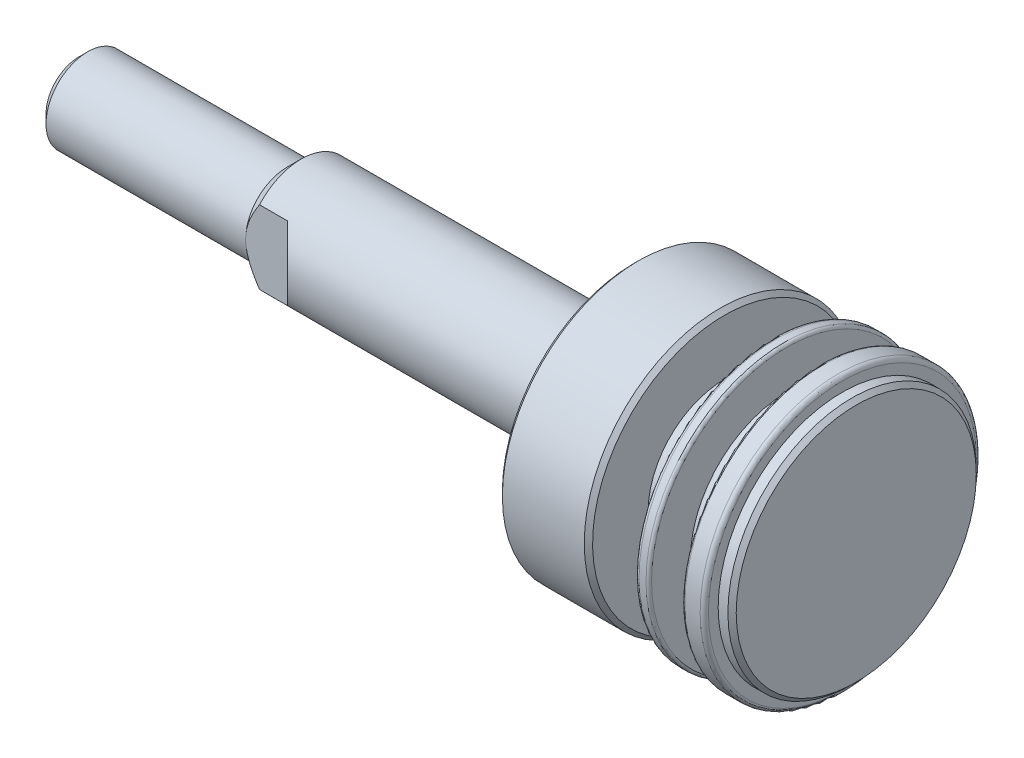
ISO-10303-21;
HEADER;
FILE_DESCRIPTION(('STEP AP214'),'2;1');
FILE_NAME('part.step','',(''),(''),'','','');
FILE_SCHEMA(('AUTOMOTIVE_DESIGN { 1 0 10303 214 1 1 1 1 }'));
ENDSEC;
DATA;
#1=APPLICATION_CONTEXT('core data for automotive mechanical design processes');
#2=APPLICATION_PROTOCOL_DEFINITION('international standard','automotive_design',2000,#1);
#3=PRODUCT_CONTEXT('',#1,'mechanical');
#4=PRODUCT('Part','Part','',(#3));
#5=PRODUCT_RELATED_PRODUCT_CATEGORY('part','',(#4));
#6=PRODUCT_DEFINITION_FORMATION('','',#4);
#7=PRODUCT_DEFINITION_CONTEXT('part definition',#1,'design');
#8=PRODUCT_DEFINITION('design','',#6,#7);
#9=PRODUCT_DEFINITION_SHAPE('','',#8);
#10=(LENGTH_UNIT() NAMED_UNIT(*) SI_UNIT(.MILLI.,.METRE.));
#11=(NAMED_UNIT(*) PLANE_ANGLE_UNIT() SI_UNIT($,.RADIAN.));
#12=(NAMED_UNIT(*) SI_UNIT($,.STERADIAN.) SOLID_ANGLE_UNIT());
#13=UNCERTAINTY_MEASURE_WITH_UNIT(LENGTH_MEASURE(1.E-05),#10,'distance_accuracy_value','');
#14=(GEOMETRIC_REPRESENTATION_CONTEXT(3) GLOBAL_UNCERTAINTY_ASSIGNED_CONTEXT((#13)) GLOBAL_UNIT_ASSIGNED_CONTEXT((#10,
#11,#12)) REPRESENTATION_CONTEXT('',''));
#15=CARTESIAN_POINT('',(0.,0.,0.));
#16=DIRECTION('',(0.,0.,1.));
#17=DIRECTION('',(1.,0.,0.));
#18=AXIS2_PLACEMENT_3D('',#15,#16,#17);
#19=CARTESIAN_POINT('',(35.5,8.65,0.));
#20=DIRECTION('',(-1.,0.,0.));
#21=DIRECTION('',(0.,0.,1.));
#22=AXIS2_PLACEMENT_3D('',#19,#20,#21);
#23=PLANE('',#22);
#24=CARTESIAN_POINT('',(35.5,0.,0.));
#25=DIRECTION('',(-1.,0.,0.));
#26=DIRECTION('',(0.,0.,1.));
#27=AXIS2_PLACEMENT_3D('',#24,#25,#26);
#28=CIRCLE('',#27,8.65);
#29=CARTESIAN_POINT('',(35.5,0.,8.65));
#30=VERTEX_POINT('',#29);
#31=EDGE_CURVE('E265',#30,#30,#28,.T.);
#32=ORIENTED_EDGE('',*,*,#31,.F.);
#33=EDGE_LOOP('',(#32));
#34=FACE_BOUND('',#33,.T.);
#35=ADVANCED_FACE('F17',(#34),#23,.F.);
#36=CARTESIAN_POINT('',(35.2,0.,0.));
#37=DIRECTION('',(-1.,0.,0.));
#38=DIRECTION('',(0.,0.,1.));
#39=AXIS2_PLACEMENT_3D('',#36,#37,#38);
#40=CONICAL_SURFACE('',#39,8.95000000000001,0.785398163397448);
#41=CARTESIAN_POINT('',(35.2,0.,0.));
#42=DIRECTION('',(-1.,0.,0.));
#43=DIRECTION('',(0.,0.,1.));
#44=AXIS2_PLACEMENT_3D('',#41,#42,#43);
#45=CIRCLE('',#44,8.95);
#46=CARTESIAN_POINT('',(35.2,0.,8.95));
#47=VERTEX_POINT('',#46);
#48=EDGE_CURVE('E117',#47,#47,#45,.T.);
#49=ORIENTED_EDGE('',*,*,#48,.F.);
#50=EDGE_LOOP('',(#49));
#51=FACE_BOUND('',#50,.T.);
#52=ORIENTED_EDGE('',*,*,#31,.T.);
#53=EDGE_LOOP('',(#52));
#54=FACE_BOUND('',#53,.T.);
#55=ADVANCED_FACE('F274',(#51,#54),#40,.T.);
#56=CARTESIAN_POINT('',(35.5,0.,0.));
#57=DIRECTION('',(-1.,0.,0.));
#58=DIRECTION('',(0.,0.,1.));
#59=AXIS2_PLACEMENT_3D('',#56,#57,#58);
#60=CYLINDRICAL_SURFACE('',#59,8.95);
#61=CARTESIAN_POINT('',(34.5,0.,0.));
#62=DIRECTION('',(-1.,0.,0.));
#63=DIRECTION('',(0.,0.,1.));
#64=AXIS2_PLACEMENT_3D('',#61,#62,#63);
#65=CIRCLE('',#64,8.95);
#66=CARTESIAN_POINT('',(34.5,0.,8.95));
#67=VERTEX_POINT('',#66);
#68=EDGE_CURVE('E103',#67,#67,#65,.F.);
#69=ORIENTED_EDGE('',*,*,#68,.T.);
#70=EDGE_LOOP('',(#69));
#71=FACE_BOUND('',#70,.T.);
#72=ORIENTED_EDGE('',*,*,#48,.T.);
#73=EDGE_LOOP('',(#72));
#74=FACE_BOUND('',#73,.T.);
#75=ADVANCED_FACE('F272',(#71,#74),#60,.T.);
#76=CARTESIAN_POINT('',(34.5,9.65,0.));
#77=DIRECTION('',(-1.,0.,0.));
#78=DIRECTION('',(0.,0.,1.));
#79=AXIS2_PLACEMENT_3D('',#76,#77,#78);
#80=PLANE('',#79);
#81=ORIENTED_EDGE('',*,*,#68,.F.);
#82=EDGE_LOOP('',(#81));
#83=FACE_BOUND('',#82,.T.);
#84=CARTESIAN_POINT('',(34.5,0.,0.));
#85=DIRECTION('',(-1.,0.,0.));
#86=DIRECTION('',(0.,0.,-1.));
#87=AXIS2_PLACEMENT_3D('',#84,#85,#86);
#88=CIRCLE('',#87,9.65);
#89=CARTESIAN_POINT('',(34.5,0.,-9.65));
#90=VERTEX_POINT('',#89);
#91=CARTESIAN_POINT('',(34.5,0.,9.65));
#92=VERTEX_POINT('',#91);
#93=EDGE_CURVE('E99',#90,#92,#88,.T.);
#94=ORIENTED_EDGE('',*,*,#93,.F.);
#95=CARTESIAN_POINT('',(34.5,0.,0.));
#96=DIRECTION('',(-1.,0.,0.));
#97=DIRECTION('',(0.,0.,1.));
#98=AXIS2_PLACEMENT_3D('',#95,#96,#97);
#99=CIRCLE('',#98,9.65);
#100=EDGE_CURVE('E96',#92,#90,#99,.T.);
#101=ORIENTED_EDGE('',*,*,#100,.F.);
#102=EDGE_LOOP('',(#94,#101));
#103=FACE_BOUND('',#102,.T.);
#104=ADVANCED_FACE('F101',(#83,#103),#80,.F.);
#105=CARTESIAN_POINT('',(34.2,0.,0.));
#106=DIRECTION('',(-1.,0.,0.));
#107=DIRECTION('',(0.,0.,1.));
#108=AXIS2_PLACEMENT_3D('',#105,#106,#107);
#109=TOROIDAL_SURFACE('',#108,9.65,0.300000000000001);
#110=CARTESIAN_POINT('',(34.2,0.,0.));
#111=DIRECTION('',(-1.,0.,0.));
#112=DIRECTION('',(0.,0.,1.));
#113=AXIS2_PLACEMENT_3D('',#110,#111,#112);
#114=CIRCLE('',#113,9.95);
#115=CARTESIAN_POINT('',(34.2,0.,9.95));
#116=VERTEX_POINT('',#115);
#117=EDGE_CURVE('E108',#116,#116,#114,.T.);
#118=ORIENTED_EDGE('',*,*,#117,.F.);
#119=EDGE_LOOP('',(#118));
#120=FACE_BOUND('',#119,.T.);
#121=ORIENTED_EDGE('',*,*,#100,.T.);
#122=ORIENTED_EDGE('',*,*,#93,.T.);
#123=EDGE_LOOP('',(#121,#122));
#124=FACE_BOUND('',#123,.T.);
#125=ADVANCED_FACE('F107',(#120,#124),#109,.T.);
#126=CARTESIAN_POINT('',(35.5,0.,0.));
#127=DIRECTION('',(-1.,0.,0.));
#128=DIRECTION('',(0.,0.,1.));
#129=AXIS2_PLACEMENT_3D('',#126,#127,#128);
#130=CYLINDRICAL_SURFACE('',#129,9.95);
#131=CARTESIAN_POINT('',(33.1,0.,0.));
#132=DIRECTION('',(-1.,0.,0.));
#133=DIRECTION('',(0.,0.,1.));
#134=AXIS2_PLACEMENT_3D('',#131,#132,#133);
#135=CIRCLE('',#134,9.95);
#136=CARTESIAN_POINT('',(33.1,0.,9.95));
#137=VERTEX_POINT('',#136);
#138=EDGE_CURVE('E136',#137,#137,#135,.T.);
#139=ORIENTED_EDGE('',*,*,#138,.F.);
#140=EDGE_LOOP('',(#139));
#141=FACE_BOUND('',#140,.T.);
#142=ORIENTED_EDGE('',*,*,#117,.T.);
#143=EDGE_LOOP('',(#142));
#144=FACE_BOUND('',#143,.T.);
#145=ADVANCED_FACE('F126',(#141,#144),#130,.T.);
#146=CARTESIAN_POINT('',(33.1,0.,0.));
#147=DIRECTION('',(-1.,0.,0.));
#148=DIRECTION('',(0.,0.,1.));
#149=AXIS2_PLACEMENT_3D('',#146,#147,#148);
#150=TOROIDAL_SURFACE('',#149,9.75,0.2);
#151=CARTESIAN_POINT('',(32.9,0.,0.));
#152=DIRECTION('',(1.,0.,0.));
#153=DIRECTION('',(0.,0.,1.));
#154=AXIS2_PLACEMENT_3D('',#151,#152,#153);
#155=CIRCLE('',#154,9.75);
#156=CARTESIAN_POINT('',(32.9,0.,9.75));
#157=VERTEX_POINT('',#156);
#158=CARTESIAN_POINT('',(32.9,0.,-9.75));
#159=VERTEX_POINT('',#158);
#160=EDGE_CURVE('E139',#157,#159,#155,.T.);
#161=ORIENTED_EDGE('',*,*,#160,.T.);
#162=CARTESIAN_POINT('',(32.9,0.,0.));
#163=DIRECTION('',(1.,0.,0.));
#164=DIRECTION('',(0.,0.,-1.));
#165=AXIS2_PLACEMENT_3D('',#162,#163,#164);
#166=CIRCLE('',#165,9.75);
#167=EDGE_CURVE('E172',#159,#157,#166,.T.);
#168=ORIENTED_EDGE('',*,*,#167,.T.);
#169=EDGE_LOOP('',(#161,#168));
#170=FACE_BOUND('',#169,.T.);
#171=ORIENTED_EDGE('',*,*,#138,.T.);
#172=EDGE_LOOP('',(#171));
#173=FACE_BOUND('',#172,.T.);
#174=ADVANCED_FACE('F144',(#170,#173),#150,.T.);
#175=CARTESIAN_POINT('',(32.9,6.95,0.));
#176=DIRECTION('',(1.,0.,0.));
#177=DIRECTION('',(0.,0.,-1.));
#178=AXIS2_PLACEMENT_3D('',#175,#176,#177);
#179=PLANE('',#178);
#180=ORIENTED_EDGE('',*,*,#160,.F.);
#181=ORIENTED_EDGE('',*,*,#167,.F.);
#182=EDGE_LOOP('',(#180,#181));
#183=FACE_BOUND('',#182,.T.);
#184=CARTESIAN_POINT('',(32.9,0.,0.));
#185=DIRECTION('',(-1.,0.,0.));
#186=DIRECTION('',(0.,0.,1.));
#187=AXIS2_PLACEMENT_3D('',#184,#185,#186);
#188=CIRCLE('',#187,6.95);
#189=CARTESIAN_POINT('',(32.9,0.,6.95));
#190=VERTEX_POINT('',#189);
#191=EDGE_CURVE('E254',#190,#190,#188,.T.);
#192=ORIENTED_EDGE('',*,*,#191,.F.);
#193=EDGE_LOOP('',(#192));
#194=FACE_BOUND('',#193,.T.);
#195=ADVANCED_FACE('F153',(#183,#194),#179,.F.);
#196=CARTESIAN_POINT('',(35.5,0.,0.));
#197=DIRECTION('',(-1.,0.,0.));
#198=DIRECTION('',(0.,0.,1.));
#199=AXIS2_PLACEMENT_3D('',#196,#197,#198);
#200=CYLINDRICAL_SURFACE('',#199,6.95);
#201=CARTESIAN_POINT('',(30.5,0.,0.));
#202=DIRECTION('',(-1.,0.,0.));
#203=DIRECTION('',(0.,0.,1.));
#204=AXIS2_PLACEMENT_3D('',#201,#202,#203);
#205=CIRCLE('',#204,6.95);
#206=CARTESIAN_POINT('',(30.5,0.,6.95));
#207=VERTEX_POINT('',#206);
#208=EDGE_CURVE('E232',#207,#207,#205,.F.);
#209=ORIENTED_EDGE('',*,*,#208,.T.);
#210=EDGE_LOOP('',(#209));
#211=FACE_BOUND('',#210,.T.);
#212=ORIENTED_EDGE('',*,*,#191,.T.);
#213=EDGE_LOOP('',(#212));
#214=FACE_BOUND('',#213,.T.);
#215=ADVANCED_FACE('F609',(#211,#214),#200,.T.);
#216=CARTESIAN_POINT('',(30.5,9.75,0.));
#217=DIRECTION('',(-1.,0.,0.));
#218=DIRECTION('',(0.,0.,1.));
#219=AXIS2_PLACEMENT_3D('',#216,#217,#218);
#220=PLANE('',#219);
#221=ORIENTED_EDGE('',*,*,#208,.F.);
#222=EDGE_LOOP('',(#221));
#223=FACE_BOUND('',#222,.T.);
#224=CARTESIAN_POINT('',(30.5,0.,0.));
#225=DIRECTION('',(-1.,0.,0.));
#226=DIRECTION('',(0.,0.,-1.));
#227=AXIS2_PLACEMENT_3D('',#224,#225,#226);
#228=CIRCLE('',#227,9.75);
#229=CARTESIAN_POINT('',(30.5,0.,-9.75));
#230=VERTEX_POINT('',#229);
#231=CARTESIAN_POINT('',(30.5,0.,9.75));
#232=VERTEX_POINT('',#231);
#233=EDGE_CURVE('E213',#230,#232,#228,.T.);
#234=ORIENTED_EDGE('',*,*,#233,.F.);
#235=CARTESIAN_POINT('',(30.5,0.,0.));
#236=DIRECTION('',(-1.,0.,0.));
#237=DIRECTION('',(0.,0.,1.));
#238=AXIS2_PLACEMENT_3D('',#235,#236,#237);
#239=CIRCLE('',#238,9.75);
#240=EDGE_CURVE('E222',#232,#230,#239,.T.);
#241=ORIENTED_EDGE('',*,*,#240,.F.);
#242=EDGE_LOOP('',(#234,#241));
#243=FACE_BOUND('',#242,.T.);
#244=ADVANCED_FACE('F200',(#223,#243),#220,.F.);
#245=CARTESIAN_POINT('',(30.3,0.,0.));
#246=DIRECTION('',(-1.,0.,0.));
#247=DIRECTION('',(0.,0.,1.));
#248=AXIS2_PLACEMENT_3D('',#245,#246,#247);
#249=TOROIDAL_SURFACE('',#248,9.75,0.199999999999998);
#250=CARTESIAN_POINT('',(30.3,0.,0.));
#251=DIRECTION('',(-1.,0.,0.));
#252=DIRECTION('',(0.,0.,1.));
#253=AXIS2_PLACEMENT_3D('',#250,#251,#252);
#254=CIRCLE('',#253,9.95);
#255=CARTESIAN_POINT('',(30.3,0.,9.95));
#256=VERTEX_POINT('',#255);
#257=EDGE_CURVE('E208',#256,#256,#254,.T.);
#258=ORIENTED_EDGE('',*,*,#257,.F.);
#259=EDGE_LOOP('',(#258));
#260=FACE_BOUND('',#259,.T.);
#261=ORIENTED_EDGE('',*,*,#240,.T.);
#262=ORIENTED_EDGE('',*,*,#233,.T.);
#263=EDGE_LOOP('',(#261,#262));
#264=FACE_BOUND('',#263,.T.);
#265=ADVANCED_FACE('F188',(#260,#264),#249,.T.);
#266=CARTESIAN_POINT('',(35.5,0.,0.));
#267=DIRECTION('',(-1.,0.,0.));
#268=DIRECTION('',(0.,0.,1.));
#269=AXIS2_PLACEMENT_3D('',#266,#267,#268);
#270=CYLINDRICAL_SURFACE('',#269,9.95);
#271=CARTESIAN_POINT('',(29.8,0.,0.));
#272=DIRECTION('',(-1.,0.,0.));
#273=DIRECTION('',(0.,0.,1.));
#274=AXIS2_PLACEMENT_3D('',#271,#272,#273);
#275=CIRCLE('',#274,9.95);
#276=CARTESIAN_POINT('',(29.8,0.,9.95));
#277=VERTEX_POINT('',#276);
#278=EDGE_CURVE('E429',#277,#277,#275,.T.);
#279=ORIENTED_EDGE('',*,*,#278,.F.);
#280=EDGE_LOOP('',(#279));
#281=FACE_BOUND('',#280,.T.);
#282=ORIENTED_EDGE('',*,*,#257,.T.);
#283=EDGE_LOOP('',(#282));
#284=FACE_BOUND('',#283,.T.);
#285=ADVANCED_FACE('F199',(#281,#284),#270,.T.);
#286=CARTESIAN_POINT('',(29.8,0.,0.));
#287=DIRECTION('',(-1.,0.,0.));
#288=DIRECTION('',(0.,0.,1.));
#289=AXIS2_PLACEMENT_3D('',#286,#287,#288);
#290=TOROIDAL_SURFACE('',#289,9.65,0.299999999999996);
#291=CARTESIAN_POINT('',(29.5,0.,0.));
#292=DIRECTION('',(1.,0.,0.));
#293=DIRECTION('',(0.,0.,1.));
#294=AXIS2_PLACEMENT_3D('',#291,#292,#293);
#295=CIRCLE('',#294,9.65);
#296=CARTESIAN_POINT('',(29.5,0.,9.65));
#297=VERTEX_POINT('',#296);
#298=CARTESIAN_POINT('',(29.5,0.,-9.65));
#299=VERTEX_POINT('',#298);
#300=EDGE_CURVE('E75',#297,#299,#295,.T.);
#301=ORIENTED_EDGE('',*,*,#300,.T.);
#302=CARTESIAN_POINT('',(29.5,0.,0.));
#303=DIRECTION('',(1.,0.,0.));
#304=DIRECTION('',(0.,0.,-1.));
#305=AXIS2_PLACEMENT_3D('',#302,#303,#304);
#306=CIRCLE('',#305,9.65);
#307=EDGE_CURVE('E426',#299,#297,#306,.T.);
#308=ORIENTED_EDGE('',*,*,#307,.T.);
#309=EDGE_LOOP('',(#301,#308));
#310=FACE_BOUND('',#309,.T.);
#311=ORIENTED_EDGE('',*,*,#278,.T.);
#312=EDGE_LOOP('',(#311));
#313=FACE_BOUND('',#312,.T.);
#314=ADVANCED_FACE('F411',(#310,#313),#290,.T.);
#315=CARTESIAN_POINT('',(29.5,5.5,0.));
#316=DIRECTION('',(1.,0.,0.));
#317=DIRECTION('',(0.,0.,-1.));
#318=AXIS2_PLACEMENT_3D('',#315,#316,#317);
#319=PLANE('',#318);
#320=ORIENTED_EDGE('',*,*,#300,.F.);
#321=ORIENTED_EDGE('',*,*,#307,.F.);
#322=EDGE_LOOP('',(#320,#321));
#323=FACE_BOUND('',#322,.T.);
#324=CARTESIAN_POINT('',(29.5,0.,0.));
#325=DIRECTION('',(-1.,0.,0.));
#326=DIRECTION('',(0.,0.,1.));
#327=AXIS2_PLACEMENT_3D('',#324,#325,#326);
#328=CIRCLE('',#327,5.5);
#329=CARTESIAN_POINT('',(29.5,0.,5.5));
#330=VERTEX_POINT('',#329);
#331=EDGE_CURVE('E713',#330,#330,#328,.T.);
#332=ORIENTED_EDGE('',*,*,#331,.F.);
#333=EDGE_LOOP('',(#332));
#334=FACE_BOUND('',#333,.T.);
#335=ADVANCED_FACE('F401',(#323,#334),#319,.F.);
#336=CARTESIAN_POINT('',(35.5,0.,0.));
#337=DIRECTION('',(-1.,0.,0.));
#338=DIRECTION('',(0.,0.,1.));
#339=AXIS2_PLACEMENT_3D('',#336,#337,#338);
#340=CYLINDRICAL_SURFACE('',#339,5.5);
#341=CARTESIAN_POINT('',(26.,0.,0.));
#342=DIRECTION('',(-1.,0.,0.));
#343=DIRECTION('',(0.,0.,1.));
#344=AXIS2_PLACEMENT_3D('',#341,#342,#343);
#345=CIRCLE('',#344,5.5);
#346=CARTESIAN_POINT('',(26.,0.,5.5));
#347=VERTEX_POINT('',#346);
#348=EDGE_CURVE('E711',#347,#347,#345,.F.);
#349=ORIENTED_EDGE('',*,*,#348,.T.);
#350=EDGE_LOOP('',(#349));
#351=FACE_BOUND('',#350,.T.);
#352=ORIENTED_EDGE('',*,*,#331,.T.);
#353=EDGE_LOOP('',(#352));
#354=FACE_BOUND('',#353,.T.);
#355=ADVANCED_FACE('F410',(#351,#354),#340,.T.);
#356=CARTESIAN_POINT('',(26.,9.5,0.));
#357=DIRECTION('',(-1.,0.,0.));
#358=DIRECTION('',(0.,0.,1.));
#359=AXIS2_PLACEMENT_3D('',#356,#357,#358);
#360=PLANE('',#359);
#361=ORIENTED_EDGE('',*,*,#348,.F.);
#362=EDGE_LOOP('',(#361));
#363=FACE_BOUND('',#362,.T.);
#364=CARTESIAN_POINT('',(26.,0.,0.));
#365=DIRECTION('',(-1.,0.,0.));
#366=DIRECTION('',(0.,-1.,0.));
#367=AXIS2_PLACEMENT_3D('',#364,#365,#366);
#368=CIRCLE('',#367,9.5);
#369=CARTESIAN_POINT('',(26.,-9.5,0.));
#370=VERTEX_POINT('',#369);
#371=EDGE_CURVE('E393',#370,#370,#368,.T.);
#372=ORIENTED_EDGE('',*,*,#371,.F.);
#373=EDGE_LOOP('',(#372));
#374=FACE_BOUND('',#373,.T.);
#375=ADVANCED_FACE('F460',(#363,#374),#360,.F.);
#376=CARTESIAN_POINT('',(25.7,0.,0.));
#377=DIRECTION('',(-1.,0.,0.));
#378=DIRECTION('',(0.,-1.,0.));
#379=AXIS2_PLACEMENT_3D('',#376,#377,#378);
#380=CONICAL_SURFACE('',#379,9.8,0.785398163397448);
#381=ORIENTED_EDGE('',*,*,#371,.T.);
#382=EDGE_LOOP('',(#381));
#383=FACE_BOUND('',#382,.T.);
#384=CARTESIAN_POINT('',(25.7,0.,0.));
#385=DIRECTION('',(-1.,0.,0.));
#386=DIRECTION('',(0.,0.,1.));
#387=AXIS2_PLACEMENT_3D('',#384,#385,#386);
#388=CIRCLE('',#387,9.8);
#389=CARTESIAN_POINT('',(25.7,0.,9.8));
#390=VERTEX_POINT('',#389);
#391=EDGE_CURVE('E390',#390,#390,#388,.T.);
#392=ORIENTED_EDGE('',*,*,#391,.F.);
#393=EDGE_LOOP('',(#392));
#394=FACE_BOUND('',#393,.T.);
#395=ADVANCED_FACE('F467',(#383,#394),#380,.T.);
#396=CARTESIAN_POINT('',(-20.5,0.,0.));
#397=DIRECTION('',(1.,0.,0.));
#398=DIRECTION('',(0.,0.,-1.));
#399=AXIS2_PLACEMENT_3D('',#396,#397,#398);
#400=PLANE('',#399);
#401=CARTESIAN_POINT('',(-20.49999999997,0.,0.));
#402=DIRECTION('',(1.,0.,0.));
#403=DIRECTION('',(0.,0.,-1.));
#404=AXIS2_PLACEMENT_3D('',#401,#402,#403);
#405=CIRCLE('',#404,2.38649999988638);
#406=CARTESIAN_POINT('',(-20.49999999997,0.,-2.38649999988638));
#407=VERTEX_POINT('',#406);
#408=EDGE_CURVE('E389',#407,#407,#405,.T.);
#409=ORIENTED_EDGE('',*,*,#408,.F.);
#410=EDGE_LOOP('',(#409));
#411=FACE_BOUND('',#410,.T.);
#412=ADVANCED_FACE('F474',(#411),#400,.F.);
#413=CARTESIAN_POINT('',(35.5,0.,0.));
#414=DIRECTION('',(-1.,0.,0.));
#415=DIRECTION('',(0.,0.,1.));
#416=AXIS2_PLACEMENT_3D('',#413,#414,#415);
#417=CYLINDRICAL_SURFACE('',#416,9.8);
#418=ORIENTED_EDGE('',*,*,#391,.T.);
#419=EDGE_LOOP('',(#418));
#420=FACE_BOUND('',#419,.T.);
#421=CARTESIAN_POINT('',(19.8,0.,0.));
#422=DIRECTION('',(1.,0.,0.));
#423=DIRECTION('',(0.,0.,-1.));
#424=AXIS2_PLACEMENT_3D('',#421,#422,#423);
#425=CIRCLE('',#424,9.8);
#426=CARTESIAN_POINT('',(19.8,0.,-9.8));
#427=VERTEX_POINT('',#426);
#428=EDGE_CURVE('E386',#427,#427,#425,.F.);
#429=ORIENTED_EDGE('',*,*,#428,.F.);
#430=EDGE_LOOP('',(#429));
#431=FACE_BOUND('',#430,.T.);
#432=ADVANCED_FACE('F482',(#420,#431),#417,.T.);
#433=CARTESIAN_POINT('',(-19.8864999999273,0.,0.));
#434=DIRECTION('',(1.,0.,0.));
#435=DIRECTION('',(0.,0.,-1.));
#436=AXIS2_PLACEMENT_3D('',#433,#434,#435);
#437=CONICAL_SURFACE('',#436,2.99999999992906,0.785398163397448);
#438=CARTESIAN_POINT('',(-19.8865,0.,0.));
#439=DIRECTION('',(-1.,0.,0.));
#440=DIRECTION('',(0.,0.,1.));
#441=AXIS2_PLACEMENT_3D('',#438,#439,#440);
#442=CIRCLE('',#441,3.);
#443=CARTESIAN_POINT('',(-19.8865,0.,3.));
#444=VERTEX_POINT('',#443);
#445=EDGE_CURVE('E383',#444,#444,#442,.F.);
#446=ORIENTED_EDGE('',*,*,#445,.F.);
#447=EDGE_LOOP('',(#446));
#448=FACE_BOUND('',#447,.T.);
#449=ORIENTED_EDGE('',*,*,#408,.T.);
#450=EDGE_LOOP('',(#449));
#451=FACE_BOUND('',#450,.T.);
#452=ADVANCED_FACE('F490',(#448,#451),#437,.T.);
#453=CARTESIAN_POINT('',(19.8,0.,0.));
#454=DIRECTION('',(1.,0.,0.));
#455=DIRECTION('',(0.,1.,0.));
#456=AXIS2_PLACEMENT_3D('',#453,#454,#455);
#457=CONICAL_SURFACE('',#456,9.8,0.785398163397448);
#458=CARTESIAN_POINT('',(19.5,0.,0.));
#459=DIRECTION('',(1.,0.,0.));
#460=DIRECTION('',(0.,1.,0.));
#461=AXIS2_PLACEMENT_3D('',#458,#459,#460);
#462=CIRCLE('',#461,9.5);
#463=CARTESIAN_POINT('',(19.5,9.5,0.));
#464=VERTEX_POINT('',#463);
#465=EDGE_CURVE('E339',#464,#464,#462,.T.);
#466=ORIENTED_EDGE('',*,*,#465,.T.);
#467=EDGE_LOOP('',(#466));
#468=FACE_BOUND('',#467,.T.);
#469=ORIENTED_EDGE('',*,*,#428,.T.);
#470=EDGE_LOOP('',(#469));
#471=FACE_BOUND('',#470,.T.);
#472=ADVANCED_FACE('F498',(#468,#471),#457,.T.);
#473=CARTESIAN_POINT('',(0.,0.,0.));
#474=DIRECTION('',(-1.,0.,0.));
#475=DIRECTION('',(0.,0.,1.));
#476=AXIS2_PLACEMENT_3D('',#473,#474,#475);
#477=CYLINDRICAL_SURFACE('',#476,3.);
#478=ORIENTED_EDGE('',*,*,#445,.T.);
#479=EDGE_LOOP('',(#478));
#480=FACE_BOUND('',#479,.T.);
#481=CARTESIAN_POINT('',(-5.49999999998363,0.,0.));
#482=DIRECTION('',(1.,0.,0.));
#483=DIRECTION('',(0.,0.,-1.));
#484=AXIS2_PLACEMENT_3D('',#481,#482,#483);
#485=CIRCLE('',#484,2.9999999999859);
#486=CARTESIAN_POINT('',(-5.49999999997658,0.,-2.99999999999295));
#487=VERTEX_POINT('',#486);
#488=CARTESIAN_POINT('',(-5.49999999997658,0.,2.99999999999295));
#489=VERTEX_POINT('',#488);
#490=EDGE_CURVE('E317',#487,#489,#485,.T.);
#491=ORIENTED_EDGE('',*,*,#490,.F.);
#492=CARTESIAN_POINT('',(-5.49999999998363,0.,0.));
#493=DIRECTION('',(1.,0.,0.));
#494=DIRECTION('',(0.,0.,-1.));
#495=AXIS2_PLACEMENT_3D('',#492,#493,#494);
#496=CIRCLE('',#495,2.9999999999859);
#497=EDGE_CURVE('E67',#489,#487,#496,.T.);
#498=ORIENTED_EDGE('',*,*,#497,.F.);
#499=EDGE_LOOP('',(#491,#498));
#500=FACE_BOUND('',#499,.T.);
#501=ADVANCED_FACE('F329',(#480,#500),#477,.T.);
#502=CARTESIAN_POINT('',(-4.49999999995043,0.,0.));
#503=DIRECTION('',(1.,0.,0.));
#504=DIRECTION('',(0.,0.,-1.));
#505=AXIS2_PLACEMENT_3D('',#502,#503,#504);
#506=CONICAL_SURFACE('',#505,4.0000000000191,0.785398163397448);
#507=CARTESIAN_POINT('',(-4.4999999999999,0.,0.));
#508=DIRECTION('',(-1.,0.,0.));
#509=DIRECTION('',(0.,0.,1.));
#510=AXIS2_PLACEMENT_3D('',#507,#508,#509);
#511=CIRCLE('',#510,4.);
#512=CARTESIAN_POINT('',(-4.49999999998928,-2.6457513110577,3.));
#513=VERTEX_POINT('',#512);
#514=CARTESIAN_POINT('',(-4.49999999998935,-2.64575131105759,-3.));
#515=VERTEX_POINT('',#514);
#516=EDGE_CURVE('E367',#513,#515,#511,.F.);
#517=ORIENTED_EDGE('',*,*,#516,.F.);
#518=CARTESIAN_POINT('',(-4.49999999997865,-2.6457513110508,3.));
#519=CARTESIAN_POINT('',(-4.54376677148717,-2.57957305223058,3.));
#520=CARTESIAN_POINT('',(-4.58689929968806,-2.51297659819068,3.));
#521=CARTESIAN_POINT('',(-4.67167711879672,-2.37881643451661,3.));
#522=CARTESIAN_POINT('',(-4.71332195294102,-2.3112524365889,3.));
#523=CARTESIAN_POINT('',(-4.83608152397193,-2.10626474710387,3.));
#524=CARTESIAN_POINT('',(-4.91456071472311,-1.96723203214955,3.));
#525=CARTESIAN_POINT('',(-5.0593775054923,-1.68866176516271,3.));
#526=CARTESIAN_POINT('',(-5.12602744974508,-1.54928833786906,3.));
#527=CARTESIAN_POINT('',(-5.2466022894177,-1.26532297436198,3.));
#528=CARTESIAN_POINT('',(-5.30055451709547,-1.12074303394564,3.));
#529=CARTESIAN_POINT('',(-5.37010131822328,-0.895422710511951,3.));
#530=CARTESIAN_POINT('',(-5.39181483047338,-0.816563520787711,3.));
#531=CARTESIAN_POINT('',(-5.42975833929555,-0.657532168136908,3.));
#532=CARTESIAN_POINT('',(-5.44598924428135,-0.577360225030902,3.));
#533=CARTESIAN_POINT('',(-5.47255276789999,-0.414674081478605,3.));
#534=CARTESIAN_POINT('',(-5.48278379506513,-0.332143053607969,3.));
#535=CARTESIAN_POINT('',(-5.49653824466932,-0.166418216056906,3.));
#536=CARTESIAN_POINT('',(-5.5000527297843,-0.0832236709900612,3.));
#537=CARTESIAN_POINT('',(-5.49999999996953,0.,3.));
#538=B_SPLINE_CURVE_WITH_KNOTS('',3,(#518,#519,#520,#521,#522,#523,#524,#525,#526,#527,#528,
#529,#530,#531,#532,#533,#534,#535,#536,#537),.UNSPECIFIED.,.F.,.F.,(4,2,2,2,2,2,2,2,2,4),(0.,
0.238016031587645,0.476104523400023,0.954759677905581,1.41781524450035,1.87986476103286,
2.12508439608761,2.37026338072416,2.6194821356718,2.8690322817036),.UNSPECIFIED.);
#539=EDGE_CURVE('E311',#513,#489,#538,.T.);
#540=ORIENTED_EDGE('',*,*,#539,.T.);
#541=ORIENTED_EDGE('',*,*,#497,.T.);
#542=CARTESIAN_POINT('',(-5.4999999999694,0.,-2.99999999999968));
#543=CARTESIAN_POINT('',(-5.50000372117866,-0.0461316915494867,-2.99999999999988));
#544=CARTESIAN_POINT('',(-5.49893540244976,-0.0922565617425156,-2.99999999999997));
#545=CARTESIAN_POINT('',(-5.49468966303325,-0.18440180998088,-3.00000000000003));
#546=CARTESIAN_POINT('',(-5.49151258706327,-0.23042220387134,-3.00000000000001));
#547=CARTESIAN_POINT('',(-5.47888814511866,-0.368016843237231,-2.99999999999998));
#548=CARTESIAN_POINT('',(-5.46634726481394,-0.459322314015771,-2.99999999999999));
#549=CARTESIAN_POINT('',(-5.43396065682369,-0.638969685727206,-3.00000000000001));
#550=CARTESIAN_POINT('',(-5.41424449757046,-0.727335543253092,-3.));
#551=CARTESIAN_POINT('',(-5.3683603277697,-0.902389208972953,-3.));
#552=CARTESIAN_POINT('',(-5.34218991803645,-0.989076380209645,-3.));
#553=CARTESIAN_POINT('',(-5.2667386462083,-1.21279133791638,-3.));
#554=CARTESIAN_POINT('',(-5.2130870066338,-1.34834245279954,-3.));
#555=CARTESIAN_POINT('',(-5.09509922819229,-1.61482672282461,-3.));
#556=CARTESIAN_POINT('',(-5.03074718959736,-1.74575264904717,-3.));
#557=CARTESIAN_POINT('',(-4.89212992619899,-2.00733665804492,-3.));
#558=CARTESIAN_POINT('',(-4.81762251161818,-2.13786518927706,-3.));
#559=CARTESIAN_POINT('',(-4.7014336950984,-2.33060224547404,-3.));
#560=CARTESIAN_POINT('',(-4.66204708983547,-2.39421775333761,-3.));
#561=CARTESIAN_POINT('',(-4.58196164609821,-2.52059663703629,-3.));
#562=CARTESIAN_POINT('',(-4.54126312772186,-2.58336021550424,-3.));
#563=CARTESIAN_POINT('',(-4.49999999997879,-2.64575131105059,-3.));
#564=B_SPLINE_CURVE_WITH_KNOTS('',3,(#542,#543,#544,#545,#546,#547,#548,#549,#550,#551,#552,
#553,#554,#555,#556,#557,#558,#559,#560,#561,#562,#563),.UNSPECIFIED.,.F.,.F.,(4,2,2,2,2,2,2,2,
2,2,4),(0.,0.138369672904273,0.27671673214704,0.552819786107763,0.82416619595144,
1.0956136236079,1.53229133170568,1.96962379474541,2.42027307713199,2.64472553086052,
2.86912362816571),.UNSPECIFIED.);
#565=EDGE_CURVE('E333',#487,#515,#564,.T.);
#566=ORIENTED_EDGE('',*,*,#565,.T.);
#567=EDGE_LOOP('',(#517,#540,#541,#566));
#568=FACE_BOUND('',#567,.T.);
#569=ADVANCED_FACE('F323',(#568),#506,.T.);
#570=CARTESIAN_POINT('',(19.5,4.,0.));
#571=DIRECTION('',(1.,0.,0.));
#572=DIRECTION('',(0.,0.,-1.));
#573=AXIS2_PLACEMENT_3D('',#570,#571,#572);
#574=PLANE('',#573);
#575=ORIENTED_EDGE('',*,*,#465,.F.);
#576=EDGE_LOOP('',(#575));
#577=FACE_BOUND('',#576,.T.);
#578=CARTESIAN_POINT('',(19.5,0.,0.));
#579=DIRECTION('',(-1.,0.,0.));
#580=DIRECTION('',(0.,0.,1.));
#581=AXIS2_PLACEMENT_3D('',#578,#579,#580);
#582=CIRCLE('',#581,4.);
#583=CARTESIAN_POINT('',(19.5,0.,4.));
#584=VERTEX_POINT('',#583);
#585=EDGE_CURVE('E359',#584,#584,#582,.T.);
#586=ORIENTED_EDGE('',*,*,#585,.F.);
#587=EDGE_LOOP('',(#586));
#588=FACE_BOUND('',#587,.T.);
#589=ADVANCED_FACE('F328',(#577,#588),#574,.F.);
#590=CARTESIAN_POINT('',(-2.5,-6.,-3.));
#591=DIRECTION('',(0.707106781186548,0.,0.707106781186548));
#592=DIRECTION('',(0.707106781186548,0.,-0.707106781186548));
#593=AXIS2_PLACEMENT_3D('',#590,#591,#592);
#594=PLANE('',#593);
#595=CARTESIAN_POINT('',(-5.50000000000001,0.,0.));
#596=DIRECTION('',(0.707106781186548,0.,0.707106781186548));
#597=DIRECTION('',(-0.707106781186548,0.,0.707106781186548));
#598=AXIS2_PLACEMENT_3D('',#595,#596,#597);
#599=ELLIPSE('',#598,5.65685424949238,4.);
#600=CARTESIAN_POINT('',(-2.5,-2.64575131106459,-3.));
#601=VERTEX_POINT('',#600);
#602=CARTESIAN_POINT('',(-2.5,2.64575131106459,-3.));
#603=VERTEX_POINT('',#602);
#604=EDGE_CURVE('E354',#601,#603,#599,.T.);
#605=ORIENTED_EDGE('',*,*,#604,.F.);
#606=DIRECTION('',(0.,1.,0.));
#607=VECTOR('',#606,1.);
#608=CARTESIAN_POINT('',(-2.5,-6.,-3.));
#609=LINE('',#608,#607);
#610=EDGE_CURVE('E338',#601,#603,#609,.T.);
#611=ORIENTED_EDGE('',*,*,#610,.T.);
#612=EDGE_LOOP('',(#605,#611));
#613=FACE_BOUND('',#612,.T.);
#614=ADVANCED_FACE('F344',(#613),#594,.F.);
#615=CARTESIAN_POINT('',(-5.5,-6.,-3.));
#616=DIRECTION('',(0.,0.,1.));
#617=DIRECTION('',(1.,0.,0.));
#618=AXIS2_PLACEMENT_3D('',#615,#616,#617);
#619=PLANE('',#618);
#620=DIRECTION('',(-1.,0.,0.));
#621=VECTOR('',#620,1.);
#622=CARTESIAN_POINT('',(35.5,-2.64575131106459,-3.));
#623=LINE('',#622,#621);
#624=EDGE_CURVE('E362',#515,#601,#623,.F.);
#625=ORIENTED_EDGE('',*,*,#624,.F.);
#626=ORIENTED_EDGE('',*,*,#565,.F.);
#627=CARTESIAN_POINT('',(-4.49999999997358,2.64575131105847,-3.));
#628=CARTESIAN_POINT('',(-4.54376677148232,2.57957305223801,-3.));
#629=CARTESIAN_POINT('',(-4.58689929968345,2.51297659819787,-3.));
#630=CARTESIAN_POINT('',(-4.67167711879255,2.37881643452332,-3.));
#631=CARTESIAN_POINT('',(-4.71332195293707,2.31125243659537,-3.));
#632=CARTESIAN_POINT('',(-4.83608152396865,2.10626474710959,-3.));
#633=CARTESIAN_POINT('',(-4.91456071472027,1.96723203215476,-3.));
#634=CARTESIAN_POINT('',(-5.05937750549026,1.68866176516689,-3.));
#635=CARTESIAN_POINT('',(-5.12602744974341,1.54928833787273,-3.));
#636=CARTESIAN_POINT('',(-5.2466022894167,1.2653229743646,-3.));
#637=CARTESIAN_POINT('',(-5.30055451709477,1.12074303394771,-3.));
#638=CARTESIAN_POINT('',(-5.37010131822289,0.895422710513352,-3.));
#639=CARTESIAN_POINT('',(-5.39181483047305,0.816563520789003,-3.));
#640=CARTESIAN_POINT('',(-5.42975833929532,0.657532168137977,-3.));
#641=CARTESIAN_POINT('',(-5.44598924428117,0.577360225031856,-3.));
#642=CARTESIAN_POINT('',(-5.47255276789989,0.414674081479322,-3.));
#643=CARTESIAN_POINT('',(-5.48278379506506,0.332143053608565,-3.));
#644=CARTESIAN_POINT('',(-5.4965382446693,0.166418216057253,-3.));
#645=CARTESIAN_POINT('',(-5.5000527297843,0.0832236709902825,-3.));
#646=CARTESIAN_POINT('',(-5.49999999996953,0.,-3.));
#647=B_SPLINE_CURVE_WITH_KNOTS('',3,(#627,#628,#629,#630,#631,#632,#633,#634,#635,#636,#637,
#638,#639,#640,#641,#642,#643,#644,#645,#646),.UNSPECIFIED.,.F.,.F.,(4,2,2,2,2,2,2,2,2,4),(0.,
0.238016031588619,0.476104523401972,0.954759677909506,1.41781524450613,1.87986476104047,
2.12508439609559,2.3702633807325,2.61948213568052,2.8690322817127),.UNSPECIFIED.);
#648=CARTESIAN_POINT('',(-4.49999999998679,2.64575131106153,-3.));
#649=VERTEX_POINT('',#648);
#650=EDGE_CURVE('E318',#649,#487,#647,.T.);
#651=ORIENTED_EDGE('',*,*,#650,.F.);
#652=DIRECTION('',(-1.,0.,0.));
#653=VECTOR('',#652,1.);
#654=CARTESIAN_POINT('',(35.5,2.64575131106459,-3.));
#655=LINE('',#654,#653);
#656=EDGE_CURVE('E358',#603,#649,#655,.T.);
#657=ORIENTED_EDGE('',*,*,#656,.F.);
#658=ORIENTED_EDGE('',*,*,#610,.F.);
#659=EDGE_LOOP('',(#625,#626,#651,#657,#658));
#660=FACE_BOUND('',#659,.T.);
#661=ADVANCED_FACE('F341',(#660),#619,.F.);
#662=CARTESIAN_POINT('',(-4.49999999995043,0.,0.));
#663=DIRECTION('',(1.,0.,0.));
#664=DIRECTION('',(0.,0.,-1.));
#665=AXIS2_PLACEMENT_3D('',#662,#663,#664);
#666=CONICAL_SURFACE('',#665,4.0000000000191,0.785398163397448);
#667=ORIENTED_EDGE('',*,*,#490,.T.);
#668=CARTESIAN_POINT('',(-5.49999999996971,0.,3.00000000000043));
#669=CARTESIAN_POINT('',(-5.50000372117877,0.0461316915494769,3.00000000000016));
#670=CARTESIAN_POINT('',(-5.49893540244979,0.0922565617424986,3.00000000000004));
#671=CARTESIAN_POINT('',(-5.49468966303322,0.184401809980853,2.99999999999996));
#672=CARTESIAN_POINT('',(-5.49151258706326,0.230422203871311,2.99999999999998));
#673=CARTESIAN_POINT('',(-5.47888814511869,0.368016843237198,3.00000000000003));
#674=CARTESIAN_POINT('',(-5.46634726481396,0.459322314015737,3.00000000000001));
#675=CARTESIAN_POINT('',(-5.43396065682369,0.638969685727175,2.99999999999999));
#676=CARTESIAN_POINT('',(-5.41424449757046,0.727335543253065,3.));
#677=CARTESIAN_POINT('',(-5.36836032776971,0.902389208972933,3.));
#678=CARTESIAN_POINT('',(-5.34218991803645,0.989076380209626,3.));
#679=CARTESIAN_POINT('',(-5.26673864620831,1.21279133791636,3.));
#680=CARTESIAN_POINT('',(-5.21308700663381,1.34834245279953,3.));
#681=CARTESIAN_POINT('',(-5.09509922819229,1.6148267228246,3.));
#682=CARTESIAN_POINT('',(-5.03074718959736,1.74575264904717,3.));
#683=CARTESIAN_POINT('',(-4.89212992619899,2.00733665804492,3.));
#684=CARTESIAN_POINT('',(-4.81762251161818,2.13786518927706,3.));
#685=CARTESIAN_POINT('',(-4.70143369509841,2.33060224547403,3.));
#686=CARTESIAN_POINT('',(-4.66204708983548,2.39421775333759,3.));
#687=CARTESIAN_POINT('',(-4.58196164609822,2.52059663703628,3.));
#688=CARTESIAN_POINT('',(-4.54126312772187,2.58336021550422,3.));
#689=CARTESIAN_POINT('',(-4.49999999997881,2.64575131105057,3.));
#690=B_SPLINE_CURVE_WITH_KNOTS('',3,(#668,#669,#670,#671,#672,#673,#674,#675,#676,#677,#678,
#679,#680,#681,#682,#683,#684,#685,#686,#687,#688,#689),.UNSPECIFIED.,.F.,.F.,(4,2,2,2,2,2,2,2,
2,2,4),(0.,0.138369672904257,0.276716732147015,0.552819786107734,0.824166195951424,
1.09561362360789,1.53229133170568,1.96962379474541,2.42027307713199,2.64472553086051,
2.86912362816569),.UNSPECIFIED.);
#691=CARTESIAN_POINT('',(-4.4999999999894,2.64575131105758,3.));
#692=VERTEX_POINT('',#691);
#693=EDGE_CURVE('E305',#489,#692,#690,.T.);
#694=ORIENTED_EDGE('',*,*,#693,.T.);
#695=CARTESIAN_POINT('',(-4.5,0.,0.));
#696=DIRECTION('',(-1.,0.,0.));
#697=DIRECTION('',(0.,0.,1.));
#698=AXIS2_PLACEMENT_3D('',#695,#696,#697);
#699=CIRCLE('',#698,4.);
#700=EDGE_CURVE('E377',#649,#692,#699,.F.);
#701=ORIENTED_EDGE('',*,*,#700,.F.);
#702=ORIENTED_EDGE('',*,*,#650,.T.);
#703=EDGE_LOOP('',(#667,#694,#701,#702));
#704=FACE_BOUND('',#703,.T.);
#705=ADVANCED_FACE('F300',(#704),#666,.T.);
#706=CARTESIAN_POINT('',(-2.5,-6.,3.));
#707=DIRECTION('',(0.,0.,-1.));
#708=DIRECTION('',(-1.,0.,0.));
#709=AXIS2_PLACEMENT_3D('',#706,#707,#708);
#710=PLANE('',#709);
#711=DIRECTION('',(-1.,0.,0.));
#712=VECTOR('',#711,1.);
#713=CARTESIAN_POINT('',(35.5,2.64575131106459,3.));
#714=LINE('',#713,#712);
#715=CARTESIAN_POINT('',(-2.5,2.6457513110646,3.));
#716=VERTEX_POINT('',#715);
#717=EDGE_CURVE('E28',#692,#716,#714,.F.);
#718=ORIENTED_EDGE('',*,*,#717,.F.);
#719=ORIENTED_EDGE('',*,*,#693,.F.);
#720=ORIENTED_EDGE('',*,*,#539,.F.);
#721=DIRECTION('',(-1.,0.,0.));
#722=VECTOR('',#721,1.);
#723=CARTESIAN_POINT('',(35.5,-2.64575131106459,3.));
#724=LINE('',#723,#722);
#725=CARTESIAN_POINT('',(-2.5,-2.64575131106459,3.));
#726=VERTEX_POINT('',#725);
#727=EDGE_CURVE('E370',#726,#513,#724,.T.);
#728=ORIENTED_EDGE('',*,*,#727,.F.);
#729=DIRECTION('',(0.,1.,0.));
#730=VECTOR('',#729,1.);
#731=CARTESIAN_POINT('',(-2.5,-6.,3.));
#732=LINE('',#731,#730);
#733=EDGE_CURVE('E37',#726,#716,#732,.T.);
#734=ORIENTED_EDGE('',*,*,#733,.T.);
#735=EDGE_LOOP('',(#718,#719,#720,#728,#734));
#736=FACE_BOUND('',#735,.T.);
#737=ADVANCED_FACE('F291',(#736),#710,.F.);
#738=CARTESIAN_POINT('',(17.5,-6.,23.));
#739=DIRECTION('',(0.707106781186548,0.,-0.707106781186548));
#740=DIRECTION('',(-0.707106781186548,0.,-0.707106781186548));
#741=AXIS2_PLACEMENT_3D('',#738,#739,#740);
#742=PLANE('',#741);
#743=ORIENTED_EDGE('',*,*,#733,.F.);
#744=CARTESIAN_POINT('',(-5.5,0.,0.));
#745=DIRECTION('',(0.707106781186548,0.,-0.707106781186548));
#746=DIRECTION('',(-0.707106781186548,0.,-0.707106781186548));
#747=AXIS2_PLACEMENT_3D('',#744,#745,#746);
#748=ELLIPSE('',#747,5.65685424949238,4.);
#749=EDGE_CURVE('E11',#716,#726,#748,.T.);
#750=ORIENTED_EDGE('',*,*,#749,.F.);
#751=EDGE_LOOP('',(#743,#750));
#752=FACE_BOUND('',#751,.T.);
#753=ADVANCED_FACE('F285',(#752),#742,.F.);
#754=CARTESIAN_POINT('',(35.5,0.,0.));
#755=DIRECTION('',(-1.,0.,0.));
#756=DIRECTION('',(0.,0.,1.));
#757=AXIS2_PLACEMENT_3D('',#754,#755,#756);
#758=CYLINDRICAL_SURFACE('',#757,4.);
#759=ORIENTED_EDGE('',*,*,#624,.T.);
#760=ORIENTED_EDGE('',*,*,#604,.T.);
#761=ORIENTED_EDGE('',*,*,#656,.T.);
#762=ORIENTED_EDGE('',*,*,#700,.T.);
#763=ORIENTED_EDGE('',*,*,#717,.T.);
#764=ORIENTED_EDGE('',*,*,#749,.T.);
#765=ORIENTED_EDGE('',*,*,#727,.T.);
#766=ORIENTED_EDGE('',*,*,#516,.T.);
#767=EDGE_LOOP('',(#759,#760,#761,#762,#763,#764,#765,#766));
#768=FACE_BOUND('',#767,.T.);
#769=ORIENTED_EDGE('',*,*,#585,.T.);
#770=EDGE_LOOP('',(#769));
#771=FACE_BOUND('',#770,.T.);
#772=ADVANCED_FACE('F283',(#768,#771),#758,.T.);
#773=CLOSED_SHELL('',(#35,#55,#75,#104,#125,#145,#174,#195,#215,#244,#265,#285,#314,#335,#355,
#375,#395,#412,#432,#452,#472,#501,#569,#589,#614,#661,#705,#737,#753,#772));
#774=MANIFOLD_SOLID_BREP('B1',#773);
#775=ADVANCED_BREP_SHAPE_REPRESENTATION('',(#18,#774),#14);
#776=SHAPE_DEFINITION_REPRESENTATION(#9,#775);
ENDSEC;
END-ISO-10303-21;
